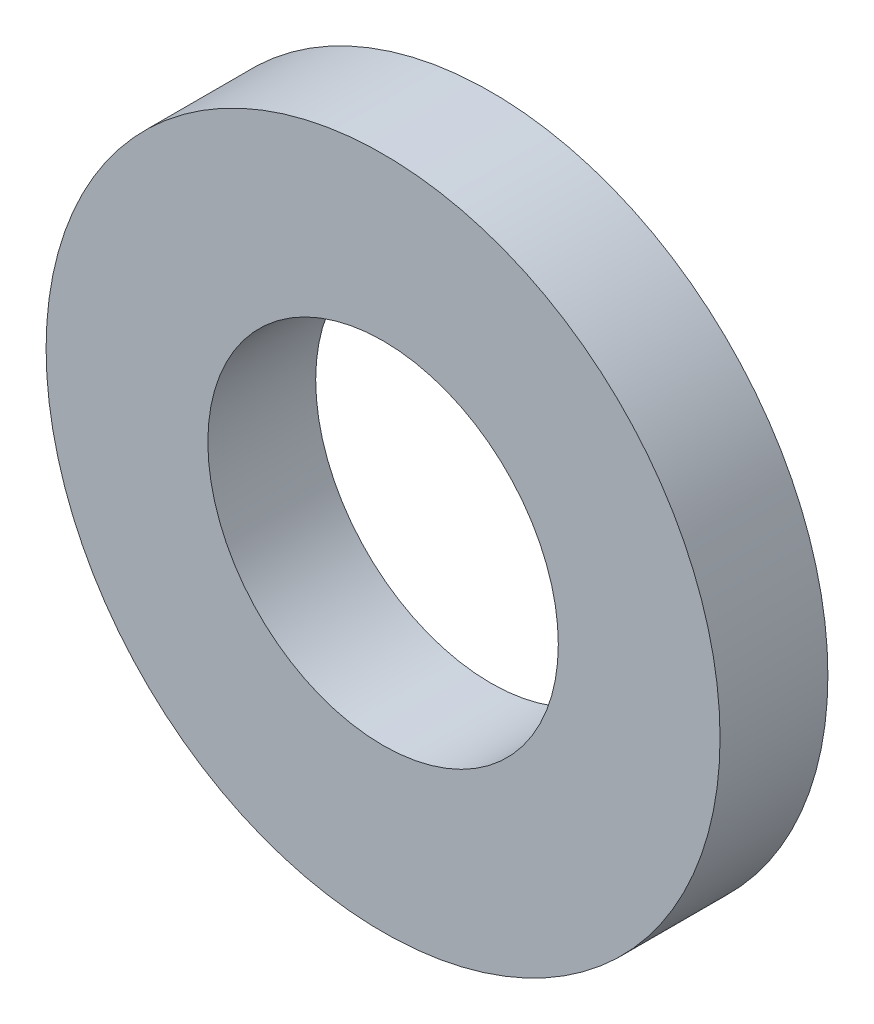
ISO-10303-21;
HEADER;
FILE_DESCRIPTION(('STEP AP214'),'2;1');
FILE_NAME('part.step','',(''),(''),'','','');
FILE_SCHEMA(('AUTOMOTIVE_DESIGN { 1 0 10303 214 1 1 1 1 }'));
ENDSEC;
DATA;
#1=APPLICATION_CONTEXT('core data for automotive mechanical design processes');
#2=APPLICATION_PROTOCOL_DEFINITION('international standard','automotive_design',2000,#1);
#3=PRODUCT_CONTEXT('',#1,'mechanical');
#4=PRODUCT('Part','Part','',(#3));
#5=PRODUCT_RELATED_PRODUCT_CATEGORY('part','',(#4));
#6=PRODUCT_DEFINITION_FORMATION('','',#4);
#7=PRODUCT_DEFINITION_CONTEXT('part definition',#1,'design');
#8=PRODUCT_DEFINITION('design','',#6,#7);
#9=PRODUCT_DEFINITION_SHAPE('','',#8);
#10=(LENGTH_UNIT() NAMED_UNIT(*) SI_UNIT(.MILLI.,.METRE.));
#11=(NAMED_UNIT(*) PLANE_ANGLE_UNIT() SI_UNIT($,.RADIAN.));
#12=(NAMED_UNIT(*) SI_UNIT($,.STERADIAN.) SOLID_ANGLE_UNIT());
#13=UNCERTAINTY_MEASURE_WITH_UNIT(LENGTH_MEASURE(1.E-05),#10,'distance_accuracy_value','');
#14=(GEOMETRIC_REPRESENTATION_CONTEXT(3) GLOBAL_UNCERTAINTY_ASSIGNED_CONTEXT((#13)) GLOBAL_UNIT_ASSIGNED_CONTEXT((#10,
#11,#12)) REPRESENTATION_CONTEXT('',''));
#15=CARTESIAN_POINT('',(0.,0.,0.));
#16=DIRECTION('',(0.,0.,1.));
#17=DIRECTION('',(1.,0.,0.));
#18=AXIS2_PLACEMENT_3D('',#15,#16,#17);
#19=CARTESIAN_POINT('',(0.,0.,4.));
#20=DIRECTION('',(0.,0.,1.));
#21=DIRECTION('',(1.,0.,0.));
#22=AXIS2_PLACEMENT_3D('',#19,#20,#21);
#23=PLANE('',#22);
#24=CARTESIAN_POINT('',(0.,0.,4.));
#25=DIRECTION('',(0.,0.,1.));
#26=DIRECTION('',(1.,0.,0.));
#27=AXIS2_PLACEMENT_3D('',#24,#25,#26);
#28=CIRCLE('',#27,12.5);
#29=CARTESIAN_POINT('',(12.5,0.,4.));
#30=VERTEX_POINT('',#29);
#31=EDGE_CURVE('E8',#30,#30,#28,.T.);
#32=ORIENTED_EDGE('',*,*,#31,.T.);
#33=EDGE_LOOP('',(#32));
#34=FACE_BOUND('',#33,.T.);
#35=CARTESIAN_POINT('',(0.,0.,4.));
#36=DIRECTION('',(0.,0.,1.));
#37=DIRECTION('',(1.,0.,0.));
#38=AXIS2_PLACEMENT_3D('',#35,#36,#37);
#39=CIRCLE('',#38,6.5);
#40=CARTESIAN_POINT('',(6.5,0.,4.));
#41=VERTEX_POINT('',#40);
#42=EDGE_CURVE('E23',#41,#41,#39,.T.);
#43=ORIENTED_EDGE('',*,*,#42,.F.);
#44=EDGE_LOOP('',(#43));
#45=FACE_BOUND('',#44,.T.);
#46=ADVANCED_FACE('F12',(#34,#45),#23,.T.);
#47=CARTESIAN_POINT('',(0.,0.,0.));
#48=DIRECTION('',(0.,0.,1.));
#49=DIRECTION('',(1.,0.,0.));
#50=AXIS2_PLACEMENT_3D('',#47,#48,#49);
#51=PLANE('',#50);
#52=CARTESIAN_POINT('',(0.,0.,0.));
#53=DIRECTION('',(0.,0.,1.));
#54=DIRECTION('',(1.,0.,0.));
#55=AXIS2_PLACEMENT_3D('',#52,#53,#54);
#56=CIRCLE('',#55,12.5);
#57=CARTESIAN_POINT('',(12.5,0.,0.));
#58=VERTEX_POINT('',#57);
#59=EDGE_CURVE('E19',#58,#58,#56,.T.);
#60=ORIENTED_EDGE('',*,*,#59,.F.);
#61=EDGE_LOOP('',(#60));
#62=FACE_BOUND('',#61,.T.);
#63=CARTESIAN_POINT('',(0.,0.,0.));
#64=DIRECTION('',(0.,0.,1.));
#65=DIRECTION('',(1.,0.,0.));
#66=AXIS2_PLACEMENT_3D('',#63,#64,#65);
#67=CIRCLE('',#66,6.5);
#68=CARTESIAN_POINT('',(6.5,0.,0.));
#69=VERTEX_POINT('',#68);
#70=EDGE_CURVE('E27',#69,#69,#67,.T.);
#71=ORIENTED_EDGE('',*,*,#70,.T.);
#72=EDGE_LOOP('',(#71));
#73=FACE_BOUND('',#72,.T.);
#74=ADVANCED_FACE('F33',(#62,#73),#51,.F.);
#75=CARTESIAN_POINT('',(0.,0.,4.));
#76=DIRECTION('',(0.,0.,-1.));
#77=DIRECTION('',(-1.,0.,0.));
#78=AXIS2_PLACEMENT_3D('',#75,#76,#77);
#79=CYLINDRICAL_SURFACE('',#78,12.5);
#80=ORIENTED_EDGE('',*,*,#31,.F.);
#81=EDGE_LOOP('',(#80));
#82=FACE_BOUND('',#81,.T.);
#83=ORIENTED_EDGE('',*,*,#59,.T.);
#84=EDGE_LOOP('',(#83));
#85=FACE_BOUND('',#84,.T.);
#86=ADVANCED_FACE('F14',(#82,#85),#79,.T.);
#87=CARTESIAN_POINT('',(0.,0.,4.));
#88=DIRECTION('',(0.,0.,-1.));
#89=DIRECTION('',(-1.,0.,0.));
#90=AXIS2_PLACEMENT_3D('',#87,#88,#89);
#91=CYLINDRICAL_SURFACE('',#90,6.5);
#92=ORIENTED_EDGE('',*,*,#42,.T.);
#93=EDGE_LOOP('',(#92));
#94=FACE_BOUND('',#93,.T.);
#95=ORIENTED_EDGE('',*,*,#70,.F.);
#96=EDGE_LOOP('',(#95));
#97=FACE_BOUND('',#96,.T.);
#98=ADVANCED_FACE('F35',(#94,#97),#91,.F.);
#99=CLOSED_SHELL('',(#46,#74,#86,#98));
#100=MANIFOLD_SOLID_BREP('B1',#99);
#101=ADVANCED_BREP_SHAPE_REPRESENTATION('',(#18,#100),#14);
#102=SHAPE_DEFINITION_REPRESENTATION(#9,#101);
ENDSEC;
END-ISO-10303-21;
